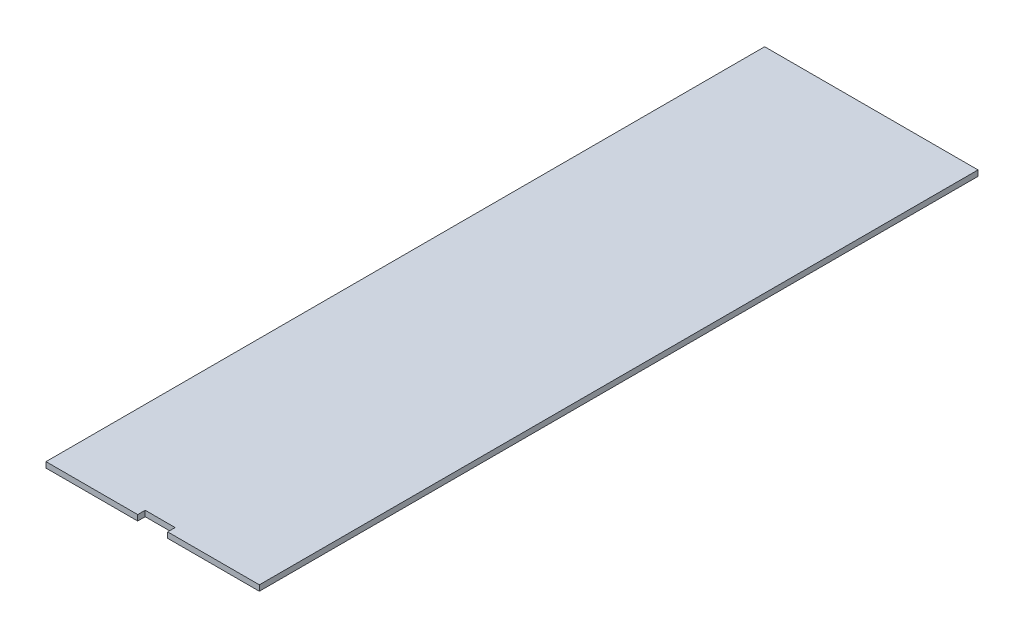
ISO-10303-21;
HEADER;
FILE_DESCRIPTION(('STEP AP214'),'2;1');
FILE_NAME('part.step','',(''),(''),'','','');
FILE_SCHEMA(('AUTOMOTIVE_DESIGN { 1 0 10303 214 1 1 1 1 }'));
ENDSEC;
DATA;
#1=APPLICATION_CONTEXT('core data for automotive mechanical design processes');
#2=APPLICATION_PROTOCOL_DEFINITION('international standard','automotive_design',2000,#1);
#3=PRODUCT_CONTEXT('',#1,'mechanical');
#4=PRODUCT('Part','Part','',(#3));
#5=PRODUCT_RELATED_PRODUCT_CATEGORY('part','',(#4));
#6=PRODUCT_DEFINITION_FORMATION('','',#4);
#7=PRODUCT_DEFINITION_CONTEXT('part definition',#1,'design');
#8=PRODUCT_DEFINITION('design','',#6,#7);
#9=PRODUCT_DEFINITION_SHAPE('','',#8);
#10=(LENGTH_UNIT() NAMED_UNIT(*) SI_UNIT(.MILLI.,.METRE.));
#11=(NAMED_UNIT(*) PLANE_ANGLE_UNIT() SI_UNIT($,.RADIAN.));
#12=(NAMED_UNIT(*) SI_UNIT($,.STERADIAN.) SOLID_ANGLE_UNIT());
#13=UNCERTAINTY_MEASURE_WITH_UNIT(LENGTH_MEASURE(1.E-05),#10,'distance_accuracy_value','');
#14=(GEOMETRIC_REPRESENTATION_CONTEXT(3) GLOBAL_UNCERTAINTY_ASSIGNED_CONTEXT((#13)) GLOBAL_UNIT_ASSIGNED_CONTEXT((#10,
#11,#12)) REPRESENTATION_CONTEXT('',''));
#15=CARTESIAN_POINT('',(0.,0.,0.));
#16=DIRECTION('',(0.,0.,1.));
#17=DIRECTION('',(1.,0.,0.));
#18=AXIS2_PLACEMENT_3D('',#15,#16,#17);
#19=CARTESIAN_POINT('',(0.,4.7625,0.));
#20=DIRECTION('',(1.,0.,0.));
#21=DIRECTION('',(0.,0.,-1.));
#22=AXIS2_PLACEMENT_3D('',#19,#20,#21);
#23=PLANE('',#22);
#24=DIRECTION('',(0.,0.,1.));
#25=VECTOR('',#24,1.);
#26=CARTESIAN_POINT('',(0.,0.,0.));
#27=LINE('',#26,#25);
#28=CARTESIAN_POINT('',(0.,0.,-609.6));
#29=VERTEX_POINT('',#28);
#30=CARTESIAN_POINT('',(0.,0.,0.));
#31=VERTEX_POINT('',#30);
#32=EDGE_CURVE('E131',#29,#31,#27,.T.);
#33=ORIENTED_EDGE('',*,*,#32,.T.);
#34=DIRECTION('',(0.,-1.,0.));
#35=VECTOR('',#34,1.);
#36=CARTESIAN_POINT('',(0.,4.7625,0.));
#37=LINE('',#36,#35);
#38=CARTESIAN_POINT('',(0.,4.7625,0.));
#39=VERTEX_POINT('',#38);
#40=EDGE_CURVE('E11',#39,#31,#37,.T.);
#41=ORIENTED_EDGE('',*,*,#40,.F.);
#42=DIRECTION('',(0.,0.,1.));
#43=VECTOR('',#42,1.);
#44=CARTESIAN_POINT('',(0.,4.7625,0.));
#45=LINE('',#44,#43);
#46=CARTESIAN_POINT('',(0.,4.7625,-609.6));
#47=VERTEX_POINT('',#46);
#48=EDGE_CURVE('E145',#47,#39,#45,.T.);
#49=ORIENTED_EDGE('',*,*,#48,.F.);
#50=DIRECTION('',(0.,-1.,0.));
#51=VECTOR('',#50,1.);
#52=CARTESIAN_POINT('',(0.,4.7625,-609.6));
#53=LINE('',#52,#51);
#54=EDGE_CURVE('E127',#47,#29,#53,.T.);
#55=ORIENTED_EDGE('',*,*,#54,.T.);
#56=EDGE_LOOP('',(#33,#41,#49,#55));
#57=FACE_BOUND('',#56,.T.);
#58=ADVANCED_FACE('F35',(#57),#23,.F.);
#59=CARTESIAN_POINT('',(0.,4.7625,0.));
#60=DIRECTION('',(0.,0.,-1.));
#61=DIRECTION('',(-1.,0.,0.));
#62=AXIS2_PLACEMENT_3D('',#59,#60,#61);
#63=PLANE('',#62);
#64=DIRECTION('',(1.,0.,0.));
#65=VECTOR('',#64,1.);
#66=CARTESIAN_POINT('',(0.,0.,0.));
#67=LINE('',#66,#65);
#68=CARTESIAN_POINT('',(77.7875,0.,0.));
#69=VERTEX_POINT('',#68);
#70=EDGE_CURVE('E134',#31,#69,#67,.T.);
#71=ORIENTED_EDGE('',*,*,#70,.T.);
#72=DIRECTION('',(0.,-1.,0.));
#73=VECTOR('',#72,1.);
#74=CARTESIAN_POINT('',(77.7875,4.7625,0.));
#75=LINE('',#74,#73);
#76=CARTESIAN_POINT('',(77.7875,4.7625,0.));
#77=VERTEX_POINT('',#76);
#78=EDGE_CURVE('E43',#77,#69,#75,.T.);
#79=ORIENTED_EDGE('',*,*,#78,.F.);
#80=DIRECTION('',(1.,0.,0.));
#81=VECTOR('',#80,1.);
#82=CARTESIAN_POINT('',(0.,4.7625,0.));
#83=LINE('',#82,#81);
#84=EDGE_CURVE('E94',#39,#77,#83,.T.);
#85=ORIENTED_EDGE('',*,*,#84,.F.);
#86=ORIENTED_EDGE('',*,*,#40,.T.);
#87=EDGE_LOOP('',(#71,#79,#85,#86));
#88=FACE_BOUND('',#87,.T.);
#89=ADVANCED_FACE('F180',(#88),#63,.F.);
#90=CARTESIAN_POINT('',(77.7875,4.7625,0.));
#91=DIRECTION('',(-1.,0.,0.));
#92=DIRECTION('',(0.,0.,1.));
#93=AXIS2_PLACEMENT_3D('',#90,#91,#92);
#94=PLANE('',#93);
#95=DIRECTION('',(0.,0.,-1.));
#96=VECTOR('',#95,1.);
#97=CARTESIAN_POINT('',(77.7875,0.,0.));
#98=LINE('',#97,#96);
#99=CARTESIAN_POINT('',(77.7875,0.,-6.35));
#100=VERTEX_POINT('',#99);
#101=EDGE_CURVE('E136',#69,#100,#98,.T.);
#102=ORIENTED_EDGE('',*,*,#101,.T.);
#103=DIRECTION('',(0.,-1.,0.));
#104=VECTOR('',#103,1.);
#105=CARTESIAN_POINT('',(77.7875,4.7625,-6.35));
#106=LINE('',#105,#104);
#107=CARTESIAN_POINT('',(77.7875,4.7625,-6.35));
#108=VERTEX_POINT('',#107);
#109=EDGE_CURVE('E152',#108,#100,#106,.T.);
#110=ORIENTED_EDGE('',*,*,#109,.F.);
#111=DIRECTION('',(0.,0.,-1.));
#112=VECTOR('',#111,1.);
#113=CARTESIAN_POINT('',(77.7875,4.7625,0.));
#114=LINE('',#113,#112);
#115=EDGE_CURVE('E160',#77,#108,#114,.T.);
#116=ORIENTED_EDGE('',*,*,#115,.F.);
#117=ORIENTED_EDGE('',*,*,#78,.T.);
#118=EDGE_LOOP('',(#102,#110,#116,#117));
#119=FACE_BOUND('',#118,.T.);
#120=ADVANCED_FACE('F158',(#119),#94,.F.);
#121=CARTESIAN_POINT('',(77.7875,4.7625,-6.35));
#122=DIRECTION('',(0.,0.,-1.));
#123=DIRECTION('',(-1.,0.,0.));
#124=AXIS2_PLACEMENT_3D('',#121,#122,#123);
#125=PLANE('',#124);
#126=DIRECTION('',(1.,0.,0.));
#127=VECTOR('',#126,1.);
#128=CARTESIAN_POINT('',(77.7875,0.,-6.35));
#129=LINE('',#128,#127);
#130=CARTESIAN_POINT('',(103.1875,0.,-6.35000000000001));
#131=VERTEX_POINT('',#130);
#132=EDGE_CURVE('E138',#100,#131,#129,.T.);
#133=ORIENTED_EDGE('',*,*,#132,.T.);
#134=DIRECTION('',(0.,-1.,0.));
#135=VECTOR('',#134,1.);
#136=CARTESIAN_POINT('',(103.1875,4.7625,-6.35000000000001));
#137=LINE('',#136,#135);
#138=CARTESIAN_POINT('',(103.1875,4.7625,-6.35000000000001));
#139=VERTEX_POINT('',#138);
#140=EDGE_CURVE('E149',#139,#131,#137,.T.);
#141=ORIENTED_EDGE('',*,*,#140,.F.);
#142=DIRECTION('',(1.,0.,0.));
#143=VECTOR('',#142,1.);
#144=CARTESIAN_POINT('',(77.7875,4.7625,-6.35));
#145=LINE('',#144,#143);
#146=EDGE_CURVE('E172',#108,#139,#145,.T.);
#147=ORIENTED_EDGE('',*,*,#146,.F.);
#148=ORIENTED_EDGE('',*,*,#109,.T.);
#149=EDGE_LOOP('',(#133,#141,#147,#148));
#150=FACE_BOUND('',#149,.T.);
#151=ADVANCED_FACE('F168',(#150),#125,.F.);
#152=CARTESIAN_POINT('',(103.1875,4.7625,0.));
#153=DIRECTION('',(1.,0.,0.));
#154=DIRECTION('',(0.,0.,-1.));
#155=AXIS2_PLACEMENT_3D('',#152,#153,#154);
#156=PLANE('',#155);
#157=DIRECTION('',(0.,0.,1.));
#158=VECTOR('',#157,1.);
#159=CARTESIAN_POINT('',(103.1875,0.,0.));
#160=LINE('',#159,#158);
#161=CARTESIAN_POINT('',(103.1875,0.,0.));
#162=VERTEX_POINT('',#161);
#163=EDGE_CURVE('E140',#131,#162,#160,.T.);
#164=ORIENTED_EDGE('',*,*,#163,.T.);
#165=DIRECTION('',(0.,-1.,0.));
#166=VECTOR('',#165,1.);
#167=CARTESIAN_POINT('',(103.1875,4.7625,0.));
#168=LINE('',#167,#166);
#169=CARTESIAN_POINT('',(103.1875,4.7625,0.));
#170=VERTEX_POINT('',#169);
#171=EDGE_CURVE('E122',#170,#162,#168,.T.);
#172=ORIENTED_EDGE('',*,*,#171,.F.);
#173=DIRECTION('',(0.,0.,1.));
#174=VECTOR('',#173,1.);
#175=CARTESIAN_POINT('',(103.1875,4.7625,0.));
#176=LINE('',#175,#174);
#177=EDGE_CURVE('E113',#139,#170,#176,.T.);
#178=ORIENTED_EDGE('',*,*,#177,.F.);
#179=ORIENTED_EDGE('',*,*,#140,.T.);
#180=EDGE_LOOP('',(#164,#172,#178,#179));
#181=FACE_BOUND('',#180,.T.);
#182=ADVANCED_FACE('F171',(#181),#156,.F.);
#183=CARTESIAN_POINT('',(103.1875,4.7625,0.));
#184=DIRECTION('',(0.,0.,-1.));
#185=DIRECTION('',(-1.,0.,0.));
#186=AXIS2_PLACEMENT_3D('',#183,#184,#185);
#187=PLANE('',#186);
#188=DIRECTION('',(1.,0.,0.));
#189=VECTOR('',#188,1.);
#190=CARTESIAN_POINT('',(103.1875,0.,0.));
#191=LINE('',#190,#189);
#192=CARTESIAN_POINT('',(180.975,0.,0.));
#193=VERTEX_POINT('',#192);
#194=EDGE_CURVE('E121',#162,#193,#191,.T.);
#195=ORIENTED_EDGE('',*,*,#194,.T.);
#196=DIRECTION('',(0.,-1.,0.));
#197=VECTOR('',#196,1.);
#198=CARTESIAN_POINT('',(180.975,4.7625,0.));
#199=LINE('',#198,#197);
#200=CARTESIAN_POINT('',(180.975,4.7625,0.));
#201=VERTEX_POINT('',#200);
#202=EDGE_CURVE('E118',#201,#193,#199,.T.);
#203=ORIENTED_EDGE('',*,*,#202,.F.);
#204=DIRECTION('',(1.,0.,0.));
#205=VECTOR('',#204,1.);
#206=CARTESIAN_POINT('',(103.1875,4.7625,0.));
#207=LINE('',#206,#205);
#208=EDGE_CURVE('E107',#170,#201,#207,.T.);
#209=ORIENTED_EDGE('',*,*,#208,.F.);
#210=ORIENTED_EDGE('',*,*,#171,.T.);
#211=EDGE_LOOP('',(#195,#203,#209,#210));
#212=FACE_BOUND('',#211,.T.);
#213=ADVANCED_FACE('F119',(#212),#187,.F.);
#214=CARTESIAN_POINT('',(180.975,4.7625,0.));
#215=DIRECTION('',(-1.,0.,0.));
#216=DIRECTION('',(0.,0.,1.));
#217=AXIS2_PLACEMENT_3D('',#214,#215,#216);
#218=PLANE('',#217);
#219=DIRECTION('',(0.,0.,-1.));
#220=VECTOR('',#219,1.);
#221=CARTESIAN_POINT('',(180.975,0.,0.));
#222=LINE('',#221,#220);
#223=CARTESIAN_POINT('',(180.975,0.,-609.6));
#224=VERTEX_POINT('',#223);
#225=EDGE_CURVE('E80',#193,#224,#222,.T.);
#226=ORIENTED_EDGE('',*,*,#225,.T.);
#227=DIRECTION('',(0.,-1.,0.));
#228=VECTOR('',#227,1.);
#229=CARTESIAN_POINT('',(180.975,4.7625,-609.6));
#230=LINE('',#229,#228);
#231=CARTESIAN_POINT('',(180.975,4.7625,-609.6));
#232=VERTEX_POINT('',#231);
#233=EDGE_CURVE('E123',#232,#224,#230,.T.);
#234=ORIENTED_EDGE('',*,*,#233,.F.);
#235=DIRECTION('',(0.,0.,-1.));
#236=VECTOR('',#235,1.);
#237=CARTESIAN_POINT('',(180.975,4.7625,0.));
#238=LINE('',#237,#236);
#239=EDGE_CURVE('E111',#201,#232,#238,.T.);
#240=ORIENTED_EDGE('',*,*,#239,.F.);
#241=ORIENTED_EDGE('',*,*,#202,.T.);
#242=EDGE_LOOP('',(#226,#234,#240,#241));
#243=FACE_BOUND('',#242,.T.);
#244=ADVANCED_FACE('F125',(#243),#218,.F.);
#245=CARTESIAN_POINT('',(0.,4.7625,-609.6));
#246=DIRECTION('',(0.,0.,1.));
#247=DIRECTION('',(1.,0.,0.));
#248=AXIS2_PLACEMENT_3D('',#245,#246,#247);
#249=PLANE('',#248);
#250=DIRECTION('',(-1.,0.,0.));
#251=VECTOR('',#250,1.);
#252=CARTESIAN_POINT('',(0.,0.,-609.6));
#253=LINE('',#252,#251);
#254=EDGE_CURVE('E86',#224,#29,#253,.T.);
#255=ORIENTED_EDGE('',*,*,#254,.T.);
#256=ORIENTED_EDGE('',*,*,#54,.F.);
#257=DIRECTION('',(-1.,0.,0.));
#258=VECTOR('',#257,1.);
#259=CARTESIAN_POINT('',(0.,4.7625,-609.6));
#260=LINE('',#259,#258);
#261=EDGE_CURVE('E51',#232,#47,#260,.T.);
#262=ORIENTED_EDGE('',*,*,#261,.F.);
#263=ORIENTED_EDGE('',*,*,#233,.T.);
#264=EDGE_LOOP('',(#255,#256,#262,#263));
#265=FACE_BOUND('',#264,.T.);
#266=ADVANCED_FACE('F196',(#265),#249,.F.);
#267=CARTESIAN_POINT('',(0.,4.7625,0.));
#268=DIRECTION('',(0.,-1.,0.));
#269=DIRECTION('',(0.,0.,-1.));
#270=AXIS2_PLACEMENT_3D('',#267,#268,#269);
#271=PLANE('',#270);
#272=ORIENTED_EDGE('',*,*,#48,.T.);
#273=ORIENTED_EDGE('',*,*,#84,.T.);
#274=ORIENTED_EDGE('',*,*,#115,.T.);
#275=ORIENTED_EDGE('',*,*,#146,.T.);
#276=ORIENTED_EDGE('',*,*,#177,.T.);
#277=ORIENTED_EDGE('',*,*,#208,.T.);
#278=ORIENTED_EDGE('',*,*,#239,.T.);
#279=ORIENTED_EDGE('',*,*,#261,.T.);
#280=EDGE_LOOP('',(#272,#273,#274,#275,#276,#277,#278,#279));
#281=FACE_BOUND('',#280,.T.);
#282=ADVANCED_FACE('F109',(#281),#271,.F.);
#283=CARTESIAN_POINT('',(0.,0.,0.));
#284=DIRECTION('',(0.,-1.,0.));
#285=DIRECTION('',(0.,0.,-1.));
#286=AXIS2_PLACEMENT_3D('',#283,#284,#285);
#287=PLANE('',#286);
#288=ORIENTED_EDGE('',*,*,#32,.F.);
#289=ORIENTED_EDGE('',*,*,#254,.F.);
#290=ORIENTED_EDGE('',*,*,#225,.F.);
#291=ORIENTED_EDGE('',*,*,#194,.F.);
#292=ORIENTED_EDGE('',*,*,#163,.F.);
#293=ORIENTED_EDGE('',*,*,#132,.F.);
#294=ORIENTED_EDGE('',*,*,#101,.F.);
#295=ORIENTED_EDGE('',*,*,#70,.F.);
#296=EDGE_LOOP('',(#288,#289,#290,#291,#292,#293,#294,#295));
#297=FACE_BOUND('',#296,.T.);
#298=ADVANCED_FACE('F164',(#297),#287,.T.);
#299=CLOSED_SHELL('',(#58,#89,#120,#151,#182,#213,#244,#266,#282,#298));
#300=MANIFOLD_SOLID_BREP('B2',#299);
#301=ADVANCED_BREP_SHAPE_REPRESENTATION('',(#18,#300),#14);
#302=SHAPE_DEFINITION_REPRESENTATION(#9,#301);
ENDSEC;
END-ISO-10303-21;
